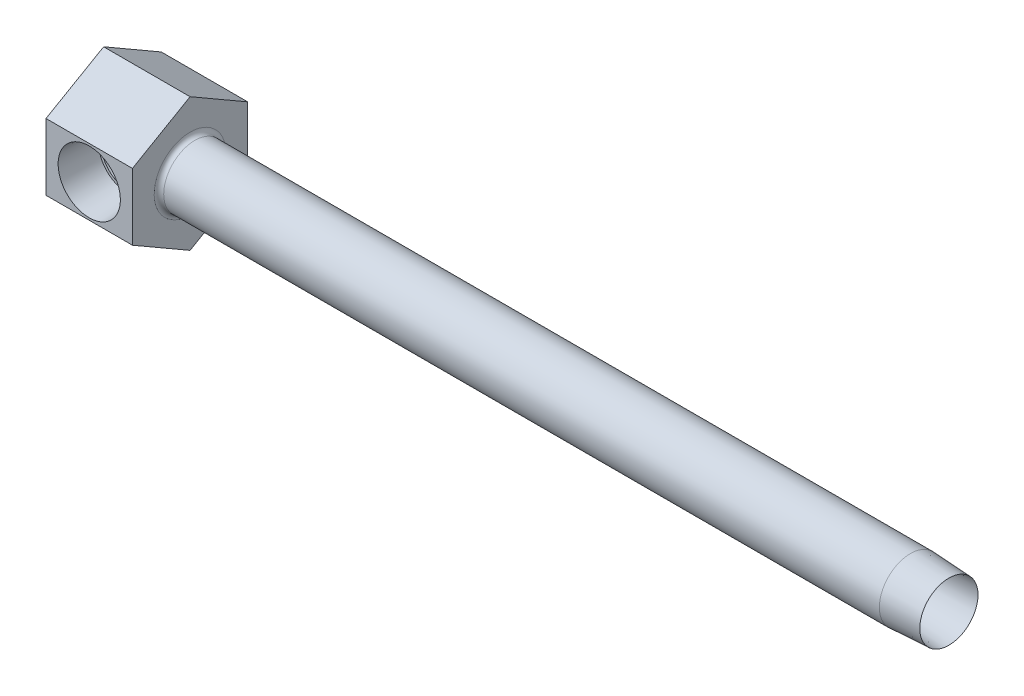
ISO-10303-21;
HEADER;
FILE_DESCRIPTION(('STEP AP214'),'2;1');
FILE_NAME('part.step','',(''),(''),'','','');
FILE_SCHEMA(('AUTOMOTIVE_DESIGN { 1 0 10303 214 1 1 1 1 }'));
ENDSEC;
DATA;
#1=APPLICATION_CONTEXT('core data for automotive mechanical design processes');
#2=APPLICATION_PROTOCOL_DEFINITION('international standard','automotive_design',2000,#1);
#3=PRODUCT_CONTEXT('',#1,'mechanical');
#4=PRODUCT('Part','Part','',(#3));
#5=PRODUCT_RELATED_PRODUCT_CATEGORY('part','',(#4));
#6=PRODUCT_DEFINITION_FORMATION('','',#4);
#7=PRODUCT_DEFINITION_CONTEXT('part definition',#1,'design');
#8=PRODUCT_DEFINITION('design','',#6,#7);
#9=PRODUCT_DEFINITION_SHAPE('','',#8);
#10=(LENGTH_UNIT() NAMED_UNIT(*) SI_UNIT(.MILLI.,.METRE.));
#11=(NAMED_UNIT(*) PLANE_ANGLE_UNIT() SI_UNIT($,.RADIAN.));
#12=(NAMED_UNIT(*) SI_UNIT($,.STERADIAN.) SOLID_ANGLE_UNIT());
#13=UNCERTAINTY_MEASURE_WITH_UNIT(LENGTH_MEASURE(1.E-05),#10,'distance_accuracy_value','');
#14=(GEOMETRIC_REPRESENTATION_CONTEXT(3) GLOBAL_UNCERTAINTY_ASSIGNED_CONTEXT((#13)) GLOBAL_UNIT_ASSIGNED_CONTEXT((#10,
#11,#12)) REPRESENTATION_CONTEXT('',''));
#15=CARTESIAN_POINT('',(0.,0.,0.));
#16=DIRECTION('',(0.,0.,1.));
#17=DIRECTION('',(1.,0.,0.));
#18=AXIS2_PLACEMENT_3D('',#15,#16,#17);
#19=CARTESIAN_POINT('',(63.5,0.,9.525));
#20=DIRECTION('',(1.,0.,0.));
#21=DIRECTION('',(0.,0.,-1.));
#22=AXIS2_PLACEMENT_3D('',#19,#20,#21);
#23=CONICAL_SURFACE('',#22,0.,0.0630490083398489);
#24=CARTESIAN_POINT('',(139.7,0.,9.525));
#25=DIRECTION('',(-1.,0.,0.));
#26=DIRECTION('',(0.,0.,1.));
#27=AXIS2_PLACEMENT_3D('',#24,#25,#26);
#28=CIRCLE('',#27,4.81071060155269);
#29=CARTESIAN_POINT('',(139.7,0.,14.3357106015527));
#30=VERTEX_POINT('',#29);
#31=EDGE_CURVE('E262',#30,#30,#28,.T.);
#32=ORIENTED_EDGE('',*,*,#31,.F.);
#33=EDGE_LOOP('',(#32));
#34=FACE_BOUND('',#33,.T.);
#35=CARTESIAN_POINT('',(132.649997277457,0.,9.525));
#36=DIRECTION('',(1.,0.,0.));
#37=DIRECTION('',(0.,0.,-1.));
#38=AXIS2_PLACEMENT_3D('',#35,#36,#37);
#39=CIRCLE('',#38,4.365625);
#40=CARTESIAN_POINT('',(132.649997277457,0.,5.159375));
#41=VERTEX_POINT('',#40);
#42=EDGE_CURVE('E111',#41,#41,#39,.T.);
#43=ORIENTED_EDGE('',*,*,#42,.F.);
#44=EDGE_LOOP('',(#43));
#45=FACE_BOUND('',#44,.T.);
#46=ADVANCED_FACE('F15',(#34,#45),#23,.F.);
#47=CARTESIAN_POINT('',(7.14375,0.,19.05));
#48=DIRECTION('',(0.,0.,1.));
#49=DIRECTION('',(1.,0.,0.));
#50=AXIS2_PLACEMENT_3D('',#47,#48,#49);
#51=CONICAL_SURFACE('',#50,5.1435,0.0523598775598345);
#52=CARTESIAN_POINT('',(7.14375,0.,19.05));
#53=DIRECTION('',(0.,0.,-1.));
#54=DIRECTION('',(-1.,0.,0.));
#55=AXIS2_PLACEMENT_3D('',#52,#53,#54);
#56=CIRCLE('',#55,5.1435);
#57=CARTESIAN_POINT('',(2.00025,0.,19.05));
#58=VERTEX_POINT('',#57);
#59=EDGE_CURVE('E290',#58,#58,#56,.T.);
#60=ORIENTED_EDGE('',*,*,#59,.F.);
#61=EDGE_LOOP('',(#60));
#62=FACE_BOUND('',#61,.T.);
#63=CARTESIAN_POINT('',(7.14375,0.,12.7000000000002));
#64=DIRECTION('',(0.,0.,-1.));
#65=DIRECTION('',(-1.,0.,0.));
#66=AXIS2_PLACEMENT_3D('',#63,#64,#65);
#67=CIRCLE('',#66,4.81071060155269);
#68=CARTESIAN_POINT('',(10.9073758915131,-2.99634054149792,12.7000000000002));
#69=VERTEX_POINT('',#68);
#70=CARTESIAN_POINT('',(10.9073758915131,2.99634054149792,12.7000000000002));
#71=VERTEX_POINT('',#70);
#72=EDGE_CURVE('E292',#69,#71,#67,.T.);
#73=ORIENTED_EDGE('',*,*,#72,.T.);
#74=CARTESIAN_POINT('',(10.9071937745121,2.99655245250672,12.6998000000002));
#75=CARTESIAN_POINT('',(10.971635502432,2.92155827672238,12.7705639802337));
#76=CARTESIAN_POINT('',(11.0345784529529,2.84341410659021,12.8393139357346));
#77=CARTESIAN_POINT('',(11.1569073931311,2.68056902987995,12.9723675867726));
#78=CARTESIAN_POINT('',(11.2162880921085,2.59585877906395,13.0366646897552));
#79=CARTESIAN_POINT('',(11.3887731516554,2.33059710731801,13.2228141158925));
#80=CARTESIAN_POINT('',(11.4952955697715,2.13996459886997,13.3369144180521));
#81=CARTESIAN_POINT('',(11.6670238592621,1.76978922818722,13.520146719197));
#82=CARTESIAN_POINT('',(11.7362081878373,1.59429861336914,13.5936668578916));
#83=CARTESIAN_POINT('',(11.8243838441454,1.32069459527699,13.6871793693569));
#84=CARTESIAN_POINT('',(11.8511557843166,1.22786736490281,13.7155347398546));
#85=CARTESIAN_POINT('',(11.8990876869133,1.0391950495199,13.7662595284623));
#86=CARTESIAN_POINT('',(11.9202500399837,0.943351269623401,13.7886314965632));
#87=CARTESIAN_POINT('',(11.9566990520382,0.748466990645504,13.8271421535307));
#88=CARTESIAN_POINT('',(11.971935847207,0.649406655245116,13.8432279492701));
#89=CARTESIAN_POINT('',(11.9959472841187,0.449682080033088,13.8685692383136));
#90=CARTESIAN_POINT('',(12.0047249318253,0.349018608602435,13.8778279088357));
#91=CARTESIAN_POINT('',(12.0156291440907,0.146869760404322,13.8893288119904));
#92=CARTESIAN_POINT('',(12.0177517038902,0.0453839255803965,13.8915668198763));
#93=CARTESIAN_POINT('',(12.0152840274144,-0.157407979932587,13.8889645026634));
#94=CARTESIAN_POINT('',(12.0106943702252,-0.258714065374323,13.8841247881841));
#95=CARTESIAN_POINT('',(11.9957865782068,-0.449057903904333,13.8683984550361));
#96=CARTESIAN_POINT('',(11.9861593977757,-0.538211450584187,13.8582411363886));
#97=CARTESIAN_POINT('',(11.961864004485,-0.715062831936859,13.8325939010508));
#98=CARTESIAN_POINT('',(11.9471941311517,-0.802760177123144,13.8171022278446));
#99=CARTESIAN_POINT('',(11.8959888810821,-1.06271154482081,13.762990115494));
#100=CARTESIAN_POINT('',(11.8522396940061,-1.23204639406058,13.7167134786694));
#101=CARTESIAN_POINT('',(11.7458224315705,-1.56656708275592,13.6038703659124));
#102=CARTESIAN_POINT('',(11.6823922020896,-1.73122409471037,13.5364852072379));
#103=CARTESIAN_POINT('',(11.5406571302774,-2.04618319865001,13.3853583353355));
#104=CARTESIAN_POINT('',(11.4623317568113,-2.19646504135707,13.3015940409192));
#105=CARTESIAN_POINT('',(11.3067680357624,-2.45998630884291,13.1343941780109));
#106=CARTESIAN_POINT('',(11.2311482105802,-2.57539375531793,13.0528153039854));
#107=CARTESIAN_POINT('',(11.0735639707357,-2.79452635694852,12.8818550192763));
#108=CARTESIAN_POINT('',(10.9916301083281,-2.89830245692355,12.792510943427));
#109=CARTESIAN_POINT('',(10.9071937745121,-2.99655245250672,12.6998000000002));
#110=B_SPLINE_CURVE_WITH_KNOTS('',3,(#74,#75,#76,#77,#78,#79,#80,#81,#82,#83,#84,#85,#86,#87,
#88,#89,#90,#91,#92,#93,#94,#95,#96,#97,#98,#99,#100,#101,#102,#103,#104,#105,#106,#107,#108,
#109),.UNSPECIFIED.,.F.,.F.,(4,2,2,2,2,2,2,2,2,2,2,2,2,2,2,2,2,4),(0.,0.364634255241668,
0.72979730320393,1.46525067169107,2.06997219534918,2.37170467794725,2.67330836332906,
2.97739780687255,3.28134564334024,3.58547634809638,3.88958081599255,4.15999530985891,
4.43049893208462,4.97084503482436,5.53548493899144,6.10090884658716,6.58103480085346,
7.05896806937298),.UNSPECIFIED.);
#111=EDGE_CURVE('E121',#71,#69,#110,.T.);
#112=ORIENTED_EDGE('',*,*,#111,.T.);
#113=EDGE_LOOP('',(#73,#112));
#114=FACE_BOUND('',#113,.T.);
#115=ADVANCED_FACE('F173',(#62,#114),#51,.F.);
#116=CARTESIAN_POINT('',(11.9544606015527,0.,12.7000000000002));
#117=DIRECTION('',(0.,0.,1.));
#118=DIRECTION('',(1.,0.,0.));
#119=AXIS2_PLACEMENT_3D('',#116,#117,#118);
#120=PLANE('',#119);
#121=ORIENTED_EDGE('',*,*,#72,.F.);
#122=DIRECTION('',(1.,0.,0.));
#123=VECTOR('',#122,1.);
#124=CARTESIAN_POINT('',(66.1375087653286,-2.99634054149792,12.7000000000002));
#125=LINE('',#124,#123);
#126=CARTESIAN_POINT('',(10.3187500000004,-2.99634054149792,12.7000000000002));
#127=VERTEX_POINT('',#126);
#128=EDGE_CURVE('E118',#69,#127,#125,.F.);
#129=ORIENTED_EDGE('',*,*,#128,.T.);
#130=CARTESIAN_POINT('',(7.14375,0.,12.7000000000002));
#131=DIRECTION('',(0.,0.,-1.));
#132=DIRECTION('',(-1.,0.,0.));
#133=AXIS2_PLACEMENT_3D('',#130,#131,#132);
#134=CIRCLE('',#133,4.36562500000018);
#135=CARTESIAN_POINT('',(10.3187500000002,2.99634054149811,12.7000000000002));
#136=VERTEX_POINT('',#135);
#137=EDGE_CURVE('E117',#127,#136,#134,.T.);
#138=ORIENTED_EDGE('',*,*,#137,.T.);
#139=DIRECTION('',(1.,0.,0.));
#140=VECTOR('',#139,1.);
#141=CARTESIAN_POINT('',(66.1375087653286,2.99634054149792,12.7000000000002));
#142=LINE('',#141,#140);
#143=EDGE_CURVE('E124',#136,#71,#142,.T.);
#144=ORIENTED_EDGE('',*,*,#143,.T.);
#145=EDGE_LOOP('',(#121,#129,#138,#144));
#146=FACE_BOUND('',#145,.T.);
#147=ADVANCED_FACE('F178',(#146),#120,.T.);
#148=CARTESIAN_POINT('',(7.14375,0.,35.9059426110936));
#149=DIRECTION('',(0.,0.,-1.));
#150=DIRECTION('',(-1.,0.,0.));
#151=AXIS2_PLACEMENT_3D('',#148,#149,#150);
#152=CYLINDRICAL_SURFACE('',#151,4.36562500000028);
#153=ORIENTED_EDGE('',*,*,#137,.F.);
#154=CARTESIAN_POINT('',(7.14375,0.,9.525));
#155=DIRECTION('',(0.707106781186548,0.,-0.707106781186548));
#156=DIRECTION('',(-0.707106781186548,0.,-0.707106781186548));
#157=AXIS2_PLACEMENT_3D('',#154,#155,#156);
#158=ELLIPSE('',#157,6.17392608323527,4.36562500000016);
#159=CARTESIAN_POINT('',(7.14375,-4.3656250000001,9.525));
#160=VERTEX_POINT('',#159);
#161=EDGE_CURVE('E103',#127,#160,#158,.T.);
#162=ORIENTED_EDGE('',*,*,#161,.T.);
#163=CARTESIAN_POINT('',(7.14375,0.,9.525));
#164=DIRECTION('',(-0.707106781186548,0.,-0.707106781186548));
#165=DIRECTION('',(0.707106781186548,0.,-0.707106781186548));
#166=AXIS2_PLACEMENT_3D('',#163,#164,#165);
#167=ELLIPSE('',#166,6.17392608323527,4.36562500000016);
#168=CARTESIAN_POINT('',(8.98888023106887,-3.95653586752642,7.67986976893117));
#169=VERTEX_POINT('',#168);
#170=EDGE_CURVE('E100',#160,#169,#167,.F.);
#171=ORIENTED_EDGE('',*,*,#170,.T.);
#172=CARTESIAN_POINT('',(7.14375,0.,7.67986976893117));
#173=DIRECTION('',(0.,0.,-1.));
#174=DIRECTION('',(-1.,0.,0.));
#175=AXIS2_PLACEMENT_3D('',#172,#173,#174);
#176=CIRCLE('',#175,4.36562500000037);
#177=CARTESIAN_POINT('',(8.98888023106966,3.95653586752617,7.67986976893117));
#178=VERTEX_POINT('',#177);
#179=EDGE_CURVE('E305',#169,#178,#176,.T.);
#180=ORIENTED_EDGE('',*,*,#179,.T.);
#181=CARTESIAN_POINT('',(7.14375,4.3656250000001,9.525));
#182=VERTEX_POINT('',#181);
#183=EDGE_CURVE('E30',#178,#182,#167,.F.);
#184=ORIENTED_EDGE('',*,*,#183,.T.);
#185=EDGE_CURVE('E120',#182,#136,#158,.T.);
#186=ORIENTED_EDGE('',*,*,#185,.T.);
#187=EDGE_LOOP('',(#153,#162,#171,#180,#184,#186));
#188=FACE_BOUND('',#187,.T.);
#189=ADVANCED_FACE('F114',(#188),#152,.F.);
#190=CARTESIAN_POINT('',(7.14375,0.,7.67986976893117));
#191=DIRECTION('',(0.,0.,1.));
#192=DIRECTION('',(1.,0.,0.));
#193=AXIS2_PLACEMENT_3D('',#190,#191,#192);
#194=CONICAL_SURFACE('',#193,4.36562500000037,1.0471975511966);
#195=ORIENTED_EDGE('',*,*,#179,.F.);
#196=CARTESIAN_POINT('',(8.9894997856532,-3.95662913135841,7.68006976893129));
#197=CARTESIAN_POINT('',(8.91497560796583,-3.94541760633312,7.6560189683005));
#198=CARTESIAN_POINT('',(8.84020256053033,-3.93428272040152,7.6327193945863));
#199=CARTESIAN_POINT('',(8.69001846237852,-3.91242782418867,7.58793860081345));
#200=CARTESIAN_POINT('',(8.61460714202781,-3.90170800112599,7.56645819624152));
#201=CARTESIAN_POINT('',(8.38848524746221,-3.87074056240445,7.50556917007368));
#202=CARTESIAN_POINT('',(8.2367287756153,-3.8515020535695,7.46932807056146));
#203=CARTESIAN_POINT('',(8.00667896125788,-3.82676825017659,7.42384959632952));
#204=CARTESIAN_POINT('',(7.92948623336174,-3.81920348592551,7.41015805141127));
#205=CARTESIAN_POINT('',(7.77441965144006,-3.80585437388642,7.38622945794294));
#206=CARTESIAN_POINT('',(7.69654594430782,-3.80006965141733,7.37599168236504));
#207=CARTESIAN_POINT('',(7.53967894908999,-3.79060206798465,7.35933225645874));
#208=CARTESIAN_POINT('',(7.46068163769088,-3.78693482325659,7.35293894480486));
#209=CARTESIAN_POINT('',(7.30231301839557,-3.7819879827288,7.34434534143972));
#210=CARTESIAN_POINT('',(7.2229414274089,-3.78071064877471,7.34214902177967));
#211=CARTESIAN_POINT('',(7.14355,-3.78074215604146,7.34218750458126));
#212=B_SPLINE_CURVE_WITH_KNOTS('',3,(#196,#197,#198,#199,#200,#201,#202,#203,#204,#205,#206,
#207,#208,#209,#210,#211),.UNSPECIFIED.,.F.,.F.,(4,2,2,2,2,2,2,4),(0.,0.237303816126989,
0.474713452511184,0.945835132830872,1.18204117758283,1.41819746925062,1.65607385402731,
1.89417525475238),.UNSPECIFIED.);
#213=CARTESIAN_POINT('',(7.14375,-3.78074215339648,7.34218750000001));
#214=VERTEX_POINT('',#213);
#215=EDGE_CURVE('E107',#169,#214,#212,.T.);
#216=ORIENTED_EDGE('',*,*,#215,.T.);
#217=DIRECTION('',(0.,0.866025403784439,-0.5));
#218=VECTOR('',#217,1.);
#219=CARTESIAN_POINT('',(7.14375,0.,5.159375));
#220=LINE('',#219,#218);
#221=CARTESIAN_POINT('',(7.14375,0.,5.159375));
#222=VERTEX_POINT('',#221);
#223=EDGE_CURVE('E140',#214,#222,#220,.T.);
#224=ORIENTED_EDGE('',*,*,#223,.T.);
#225=DIRECTION('',(0.,0.866025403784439,0.5));
#226=VECTOR('',#225,1.);
#227=CARTESIAN_POINT('',(7.14375,0.,5.159375));
#228=LINE('',#227,#226);
#229=CARTESIAN_POINT('',(7.14375,3.78074215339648,7.34218750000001));
#230=VERTEX_POINT('',#229);
#231=EDGE_CURVE('E135',#222,#230,#228,.T.);
#232=ORIENTED_EDGE('',*,*,#231,.T.);
#233=CARTESIAN_POINT('',(7.14355,3.78074215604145,7.34218750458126));
#234=CARTESIAN_POINT('',(7.20515303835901,3.78073202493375,7.34217451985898));
#235=CARTESIAN_POINT('',(7.26674694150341,3.78149280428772,7.34348695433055));
#236=CARTESIAN_POINT('',(7.38976236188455,3.78448017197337,7.34867189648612));
#237=CARTESIAN_POINT('',(7.45118394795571,3.78670605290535,7.3525431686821));
#238=CARTESIAN_POINT('',(7.63466542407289,3.79545033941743,7.36782927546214));
#239=CARTESIAN_POINT('',(7.75632841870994,3.80403629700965,7.38291749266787));
#240=CARTESIAN_POINT('',(8.11659337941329,3.83592256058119,7.44024735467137));
#241=CARTESIAN_POINT('',(8.35266311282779,3.8653919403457,7.49460284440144));
#242=CARTESIAN_POINT('',(8.65303625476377,3.90716169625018,7.57737916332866));
#243=CARTESIAN_POINT('',(8.72054620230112,3.91683509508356,7.59689306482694));
#244=CARTESIAN_POINT('',(8.855265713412,3.93652410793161,7.63741882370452));
#245=CARTESIAN_POINT('',(8.92247399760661,3.94654056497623,7.65843453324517));
#246=CARTESIAN_POINT('',(8.9894997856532,3.9566291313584,7.68006976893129));
#247=B_SPLINE_CURVE_WITH_KNOTS('',3,(#233,#234,#235,#236,#237,#238,#239,#240,#241,#242,#243,
#244,#245,#246),.UNSPECIFIED.,.F.,.F.,(4,2,2,2,2,2,4),(0.,0.184774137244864,0.369459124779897,
0.73767480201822,1.46761028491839,1.68043381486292,1.89382432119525),.UNSPECIFIED.);
#248=EDGE_CURVE('E139',#230,#178,#247,.T.);
#249=ORIENTED_EDGE('',*,*,#248,.T.);
#250=EDGE_LOOP('',(#195,#216,#224,#232,#249));
#251=FACE_BOUND('',#250,.T.);
#252=ADVANCED_FACE('F138',(#251),#194,.F.);
#253=CARTESIAN_POINT('',(14.2875,5.4992613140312,19.05));
#254=DIRECTION('',(0.,0.,-1.));
#255=DIRECTION('',(-1.,0.,0.));
#256=AXIS2_PLACEMENT_3D('',#253,#254,#255);
#257=PLANE('',#256);
#258=DIRECTION('',(0.,-1.,0.));
#259=VECTOR('',#258,1.);
#260=CARTESIAN_POINT('',(0.,5.4992613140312,19.05));
#261=LINE('',#260,#259);
#262=CARTESIAN_POINT('',(0.,5.4992613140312,19.05));
#263=VERTEX_POINT('',#262);
#264=CARTESIAN_POINT('',(0.,-5.49926131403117,19.05));
#265=VERTEX_POINT('',#264);
#266=EDGE_CURVE('E250',#263,#265,#261,.T.);
#267=ORIENTED_EDGE('',*,*,#266,.T.);
#268=DIRECTION('',(-1.,0.,0.));
#269=VECTOR('',#268,1.);
#270=CARTESIAN_POINT('',(14.2875,-5.49926131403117,19.05));
#271=LINE('',#270,#269);
#272=CARTESIAN_POINT('',(14.2875,-5.49926131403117,19.05));
#273=VERTEX_POINT('',#272);
#274=EDGE_CURVE('E275',#273,#265,#271,.T.);
#275=ORIENTED_EDGE('',*,*,#274,.F.);
#276=DIRECTION('',(0.,-1.,0.));
#277=VECTOR('',#276,1.);
#278=CARTESIAN_POINT('',(14.2875,5.4992613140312,19.05));
#279=LINE('',#278,#277);
#280=CARTESIAN_POINT('',(14.2875,5.4992613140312,19.05));
#281=VERTEX_POINT('',#280);
#282=EDGE_CURVE('E268',#281,#273,#279,.T.);
#283=ORIENTED_EDGE('',*,*,#282,.F.);
#284=DIRECTION('',(-1.,0.,0.));
#285=VECTOR('',#284,1.);
#286=CARTESIAN_POINT('',(14.2875,5.4992613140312,19.05));
#287=LINE('',#286,#285);
#288=EDGE_CURVE('E278',#281,#263,#287,.T.);
#289=ORIENTED_EDGE('',*,*,#288,.T.);
#290=EDGE_LOOP('',(#267,#275,#283,#289));
#291=FACE_BOUND('',#290,.T.);
#292=ORIENTED_EDGE('',*,*,#59,.T.);
#293=EDGE_LOOP('',(#292));
#294=FACE_BOUND('',#293,.T.);
#295=ADVANCED_FACE('F199',(#291,#294),#257,.F.);
#296=CARTESIAN_POINT('',(14.2875,-5.49926131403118,0.));
#297=DIRECTION('',(1.,0.,0.));
#298=DIRECTION('',(0.,1.,0.));
#299=AXIS2_PLACEMENT_3D('',#296,#297,#298);
#300=PLANE('',#299);
#301=CARTESIAN_POINT('',(14.2875,0.,9.525));
#302=DIRECTION('',(1.,0.,0.));
#303=DIRECTION('',(0.,1.,0.));
#304=AXIS2_PLACEMENT_3D('',#301,#302,#303);
#305=CIRCLE('',#304,5.9309);
#306=CARTESIAN_POINT('',(14.2875,5.9309,9.525));
#307=VERTEX_POINT('',#306);
#308=EDGE_CURVE('E23',#307,#307,#305,.F.);
#309=ORIENTED_EDGE('',*,*,#308,.T.);
#310=EDGE_LOOP('',(#309));
#311=FACE_BOUND('',#310,.T.);
#312=DIRECTION('',(0.,0.5,-0.866025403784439));
#313=VECTOR('',#312,1.);
#314=CARTESIAN_POINT('',(14.2875,-10.9985226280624,9.525));
#315=LINE('',#314,#313);
#316=CARTESIAN_POINT('',(14.2875,-10.9985226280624,9.525));
#317=VERTEX_POINT('',#316);
#318=CARTESIAN_POINT('',(14.2875,-5.49926131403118,0.));
#319=VERTEX_POINT('',#318);
#320=EDGE_CURVE('E259',#317,#319,#315,.T.);
#321=ORIENTED_EDGE('',*,*,#320,.T.);
#322=DIRECTION('',(0.,1.,0.));
#323=VECTOR('',#322,1.);
#324=CARTESIAN_POINT('',(14.2875,-5.49926131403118,0.));
#325=LINE('',#324,#323);
#326=CARTESIAN_POINT('',(14.2875,5.49926131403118,0.));
#327=VERTEX_POINT('',#326);
#328=EDGE_CURVE('E263',#319,#327,#325,.T.);
#329=ORIENTED_EDGE('',*,*,#328,.T.);
#330=DIRECTION('',(0.,0.5,0.866025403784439));
#331=VECTOR('',#330,1.);
#332=CARTESIAN_POINT('',(14.2875,5.49926131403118,0.));
#333=LINE('',#332,#331);
#334=CARTESIAN_POINT('',(14.2875,10.9985226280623,9.525));
#335=VERTEX_POINT('',#334);
#336=EDGE_CURVE('E239',#327,#335,#333,.T.);
#337=ORIENTED_EDGE('',*,*,#336,.T.);
#338=DIRECTION('',(0.,-0.5,0.86602540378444));
#339=VECTOR('',#338,1.);
#340=CARTESIAN_POINT('',(14.2875,10.9985226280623,9.525));
#341=LINE('',#340,#339);
#342=EDGE_CURVE('E266',#335,#281,#341,.T.);
#343=ORIENTED_EDGE('',*,*,#342,.T.);
#344=ORIENTED_EDGE('',*,*,#282,.T.);
#345=DIRECTION('',(0.,-0.5,-0.866025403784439));
#346=VECTOR('',#345,1.);
#347=CARTESIAN_POINT('',(14.2875,-5.49926131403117,19.05));
#348=LINE('',#347,#346);
#349=EDGE_CURVE('E38',#273,#317,#348,.T.);
#350=ORIENTED_EDGE('',*,*,#349,.T.);
#351=EDGE_LOOP('',(#321,#329,#337,#343,#344,#350));
#352=FACE_BOUND('',#351,.T.);
#353=ADVANCED_FACE('F196',(#311,#352),#300,.T.);
#354=CARTESIAN_POINT('',(14.2875,-10.9985226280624,9.525));
#355=DIRECTION('',(0.,0.866025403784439,0.5));
#356=DIRECTION('',(0.,-0.5,0.866025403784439));
#357=AXIS2_PLACEMENT_3D('',#354,#355,#356);
#358=PLANE('',#357);
#359=DIRECTION('',(0.,0.5,-0.866025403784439));
#360=VECTOR('',#359,1.);
#361=CARTESIAN_POINT('',(0.,-10.9985226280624,9.525));
#362=LINE('',#361,#360);
#363=CARTESIAN_POINT('',(0.,-10.9985226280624,9.525));
#364=VERTEX_POINT('',#363);
#365=CARTESIAN_POINT('',(0.,-5.49926131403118,0.));
#366=VERTEX_POINT('',#365);
#367=EDGE_CURVE('E235',#364,#366,#362,.T.);
#368=ORIENTED_EDGE('',*,*,#367,.T.);
#369=DIRECTION('',(-1.,0.,0.));
#370=VECTOR('',#369,1.);
#371=CARTESIAN_POINT('',(14.2875,-5.49926131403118,0.));
#372=LINE('',#371,#370);
#373=EDGE_CURVE('E143',#319,#366,#372,.T.);
#374=ORIENTED_EDGE('',*,*,#373,.F.);
#375=ORIENTED_EDGE('',*,*,#320,.F.);
#376=DIRECTION('',(-1.,0.,0.));
#377=VECTOR('',#376,1.);
#378=CARTESIAN_POINT('',(14.2875,-10.9985226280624,9.525));
#379=LINE('',#378,#377);
#380=EDGE_CURVE('E271',#317,#364,#379,.T.);
#381=ORIENTED_EDGE('',*,*,#380,.T.);
#382=EDGE_LOOP('',(#368,#374,#375,#381));
#383=FACE_BOUND('',#382,.T.);
#384=ADVANCED_FACE('F17',(#383),#358,.F.);
#385=CARTESIAN_POINT('',(14.2875,-5.49926131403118,0.));
#386=DIRECTION('',(0.,0.,1.));
#387=DIRECTION('',(0.,-1.,0.));
#388=AXIS2_PLACEMENT_3D('',#385,#386,#387);
#389=PLANE('',#388);
#390=DIRECTION('',(0.,1.,0.));
#391=VECTOR('',#390,1.);
#392=CARTESIAN_POINT('',(0.,-5.49926131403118,0.));
#393=LINE('',#392,#391);
#394=CARTESIAN_POINT('',(0.,5.49926131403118,0.));
#395=VERTEX_POINT('',#394);
#396=EDGE_CURVE('E225',#366,#395,#393,.T.);
#397=ORIENTED_EDGE('',*,*,#396,.T.);
#398=DIRECTION('',(-1.,0.,0.));
#399=VECTOR('',#398,1.);
#400=CARTESIAN_POINT('',(14.2875,5.49926131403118,0.));
#401=LINE('',#400,#399);
#402=EDGE_CURVE('E227',#327,#395,#401,.T.);
#403=ORIENTED_EDGE('',*,*,#402,.F.);
#404=ORIENTED_EDGE('',*,*,#328,.F.);
#405=ORIENTED_EDGE('',*,*,#373,.T.);
#406=EDGE_LOOP('',(#397,#403,#404,#405));
#407=FACE_BOUND('',#406,.T.);
#408=ADVANCED_FACE('F213',(#407),#389,.F.);
#409=CARTESIAN_POINT('',(14.2875,5.49926131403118,0.));
#410=DIRECTION('',(0.,-0.866025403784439,0.5));
#411=DIRECTION('',(0.,-0.5,-0.866025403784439));
#412=AXIS2_PLACEMENT_3D('',#409,#410,#411);
#413=PLANE('',#412);
#414=DIRECTION('',(0.,0.5,0.866025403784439));
#415=VECTOR('',#414,1.);
#416=CARTESIAN_POINT('',(0.,5.49926131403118,0.));
#417=LINE('',#416,#415);
#418=CARTESIAN_POINT('',(0.,10.9985226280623,9.525));
#419=VERTEX_POINT('',#418);
#420=EDGE_CURVE('E234',#395,#419,#417,.T.);
#421=ORIENTED_EDGE('',*,*,#420,.T.);
#422=DIRECTION('',(-1.,0.,0.));
#423=VECTOR('',#422,1.);
#424=CARTESIAN_POINT('',(14.2875,10.9985226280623,9.525));
#425=LINE('',#424,#423);
#426=EDGE_CURVE('E240',#335,#419,#425,.T.);
#427=ORIENTED_EDGE('',*,*,#426,.F.);
#428=ORIENTED_EDGE('',*,*,#336,.F.);
#429=ORIENTED_EDGE('',*,*,#402,.T.);
#430=EDGE_LOOP('',(#421,#427,#428,#429));
#431=FACE_BOUND('',#430,.T.);
#432=ADVANCED_FACE('F210',(#431),#413,.F.);
#433=CARTESIAN_POINT('',(14.2875,10.9985226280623,9.525));
#434=DIRECTION('',(0.,-0.86602540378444,-0.5));
#435=DIRECTION('',(0.,0.5,-0.86602540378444));
#436=AXIS2_PLACEMENT_3D('',#433,#434,#435);
#437=PLANE('',#436);
#438=DIRECTION('',(0.,-0.5,0.86602540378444));
#439=VECTOR('',#438,1.);
#440=CARTESIAN_POINT('',(0.,10.9985226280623,9.525));
#441=LINE('',#440,#439);
#442=EDGE_CURVE('E244',#419,#263,#441,.T.);
#443=ORIENTED_EDGE('',*,*,#442,.T.);
#444=ORIENTED_EDGE('',*,*,#288,.F.);
#445=ORIENTED_EDGE('',*,*,#342,.F.);
#446=ORIENTED_EDGE('',*,*,#426,.T.);
#447=EDGE_LOOP('',(#443,#444,#445,#446));
#448=FACE_BOUND('',#447,.T.);
#449=ADVANCED_FACE('F203',(#448),#437,.F.);
#450=CARTESIAN_POINT('',(14.2875,-5.49926131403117,19.05));
#451=DIRECTION('',(0.,0.866025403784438,-0.5));
#452=DIRECTION('',(0.,0.5,0.866025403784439));
#453=AXIS2_PLACEMENT_3D('',#450,#451,#452);
#454=PLANE('',#453);
#455=DIRECTION('',(0.,-0.5,-0.866025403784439));
#456=VECTOR('',#455,1.);
#457=CARTESIAN_POINT('',(0.,-5.49926131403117,19.05));
#458=LINE('',#457,#456);
#459=EDGE_CURVE('E256',#265,#364,#458,.T.);
#460=ORIENTED_EDGE('',*,*,#459,.T.);
#461=ORIENTED_EDGE('',*,*,#380,.F.);
#462=ORIENTED_EDGE('',*,*,#349,.F.);
#463=ORIENTED_EDGE('',*,*,#274,.T.);
#464=EDGE_LOOP('',(#460,#461,#462,#463));
#465=FACE_BOUND('',#464,.T.);
#466=ADVANCED_FACE('F194',(#465),#454,.F.);
#467=CARTESIAN_POINT('',(0.,-5.49926131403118,0.));
#468=DIRECTION('',(1.,0.,0.));
#469=DIRECTION('',(0.,1.,0.));
#470=AXIS2_PLACEMENT_3D('',#467,#468,#469);
#471=PLANE('',#470);
#472=ORIENTED_EDGE('',*,*,#367,.F.);
#473=ORIENTED_EDGE('',*,*,#459,.F.);
#474=ORIENTED_EDGE('',*,*,#266,.F.);
#475=ORIENTED_EDGE('',*,*,#442,.F.);
#476=ORIENTED_EDGE('',*,*,#420,.F.);
#477=ORIENTED_EDGE('',*,*,#396,.F.);
#478=EDGE_LOOP('',(#472,#473,#474,#475,#476,#477));
#479=FACE_BOUND('',#478,.T.);
#480=ADVANCED_FACE('F190',(#479),#471,.F.);
#481=CARTESIAN_POINT('',(68.0114010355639,0.,9.525));
#482=DIRECTION('',(-1.,0.,0.));
#483=DIRECTION('',(0.,0.,1.));
#484=AXIS2_PLACEMENT_3D('',#481,#482,#483);
#485=CYLINDRICAL_SURFACE('',#484,5.1435);
#486=CARTESIAN_POINT('',(15.0749,0.,9.525));
#487=DIRECTION('',(1.,0.,0.));
#488=DIRECTION('',(0.,1.,0.));
#489=AXIS2_PLACEMENT_3D('',#486,#487,#488);
#490=CIRCLE('',#489,5.1435);
#491=CARTESIAN_POINT('',(15.0749,5.1435,9.525));
#492=VERTEX_POINT('',#491);
#493=EDGE_CURVE('E10',#492,#492,#490,.T.);
#494=ORIENTED_EDGE('',*,*,#493,.T.);
#495=EDGE_LOOP('',(#494));
#496=FACE_BOUND('',#495,.T.);
#497=CARTESIAN_POINT('',(133.35,0.,9.525));
#498=DIRECTION('',(-1.,0.,0.));
#499=DIRECTION('',(0.,0.,1.));
#500=AXIS2_PLACEMENT_3D('',#497,#498,#499);
#501=CIRCLE('',#500,5.1435);
#502=CARTESIAN_POINT('',(133.35,0.,14.6685));
#503=VERTEX_POINT('',#502);
#504=EDGE_CURVE('E291',#503,#503,#501,.T.);
#505=ORIENTED_EDGE('',*,*,#504,.T.);
#506=EDGE_LOOP('',(#505));
#507=FACE_BOUND('',#506,.T.);
#508=ADVANCED_FACE('F183',(#496,#507),#485,.T.);
#509=CARTESIAN_POINT('',(139.7,0.,9.525));
#510=DIRECTION('',(-1.,0.,0.));
#511=DIRECTION('',(0.,0.,1.));
#512=AXIS2_PLACEMENT_3D('',#509,#510,#511);
#513=CONICAL_SURFACE('',#512,4.81071060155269,0.0523598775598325);
#514=ORIENTED_EDGE('',*,*,#504,.F.);
#515=EDGE_LOOP('',(#514));
#516=FACE_BOUND('',#515,.T.);
#517=ORIENTED_EDGE('',*,*,#31,.T.);
#518=EDGE_LOOP('',(#517));
#519=FACE_BOUND('',#518,.T.);
#520=ADVANCED_FACE('F180',(#516,#519),#513,.T.);
#521=CARTESIAN_POINT('',(7.14375,0.,9.525));
#522=DIRECTION('',(1.,0.,0.));
#523=DIRECTION('',(0.,0.,-1.));
#524=AXIS2_PLACEMENT_3D('',#521,#522,#523);
#525=PLANE('',#524);
#526=CARTESIAN_POINT('',(7.14375,0.,9.525));
#527=DIRECTION('',(1.,0.,0.));
#528=DIRECTION('',(0.,0.,-1.));
#529=AXIS2_PLACEMENT_3D('',#526,#527,#528);
#530=CIRCLE('',#529,4.365625);
#531=EDGE_CURVE('E128',#222,#230,#530,.T.);
#532=ORIENTED_EDGE('',*,*,#531,.T.);
#533=ORIENTED_EDGE('',*,*,#231,.F.);
#534=EDGE_LOOP('',(#532,#533));
#535=FACE_BOUND('',#534,.T.);
#536=ADVANCED_FACE('F134',(#535),#525,.T.);
#537=CARTESIAN_POINT('',(66.1375087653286,0.,9.525));
#538=DIRECTION('',(1.,0.,0.));
#539=DIRECTION('',(0.,0.,-1.));
#540=AXIS2_PLACEMENT_3D('',#537,#538,#539);
#541=CYLINDRICAL_SURFACE('',#540,4.365625);
#542=ORIENTED_EDGE('',*,*,#42,.T.);
#543=EDGE_LOOP('',(#542));
#544=FACE_BOUND('',#543,.T.);
#545=ORIENTED_EDGE('',*,*,#111,.F.);
#546=ORIENTED_EDGE('',*,*,#143,.F.);
#547=ORIENTED_EDGE('',*,*,#185,.F.);
#548=ORIENTED_EDGE('',*,*,#183,.F.);
#549=ORIENTED_EDGE('',*,*,#248,.F.);
#550=ORIENTED_EDGE('',*,*,#531,.F.);
#551=EDGE_CURVE('E126',#214,#222,#530,.T.);
#552=ORIENTED_EDGE('',*,*,#551,.F.);
#553=ORIENTED_EDGE('',*,*,#215,.F.);
#554=ORIENTED_EDGE('',*,*,#170,.F.);
#555=ORIENTED_EDGE('',*,*,#161,.F.);
#556=ORIENTED_EDGE('',*,*,#128,.F.);
#557=EDGE_LOOP('',(#545,#546,#547,#548,#549,#550,#552,#553,#554,#555,#556));
#558=FACE_BOUND('',#557,.T.);
#559=ADVANCED_FACE('F102',(#544,#558),#541,.F.);
#560=ORIENTED_EDGE('',*,*,#551,.T.);
#561=ORIENTED_EDGE('',*,*,#223,.F.);
#562=EDGE_LOOP('',(#560,#561));
#563=FACE_BOUND('',#562,.T.);
#564=ADVANCED_FACE('F161',(#563),#525,.T.);
#565=CARTESIAN_POINT('',(15.0749,0.,9.525));
#566=DIRECTION('',(1.,0.,0.));
#567=DIRECTION('',(0.,1.,0.));
#568=AXIS2_PLACEMENT_3D('',#565,#566,#567);
#569=TOROIDAL_SURFACE('',#568,5.9309,0.7874);
#570=ORIENTED_EDGE('',*,*,#493,.F.);
#571=EDGE_LOOP('',(#570));
#572=FACE_BOUND('',#571,.T.);
#573=ORIENTED_EDGE('',*,*,#308,.F.);
#574=EDGE_LOOP('',(#573));
#575=FACE_BOUND('',#574,.T.);
#576=ADVANCED_FACE('F163',(#572,#575),#569,.F.);
#577=CLOSED_SHELL('',(#46,#115,#147,#189,#252,#295,#353,#384,#408,#432,#449,#466,#480,#508,#520,
#536,#559,#564,#576));
#578=MANIFOLD_SOLID_BREP('B1',#577);
#579=ADVANCED_BREP_SHAPE_REPRESENTATION('',(#18,#578),#14);
#580=SHAPE_DEFINITION_REPRESENTATION(#9,#579);
ENDSEC;
END-ISO-10303-21;
